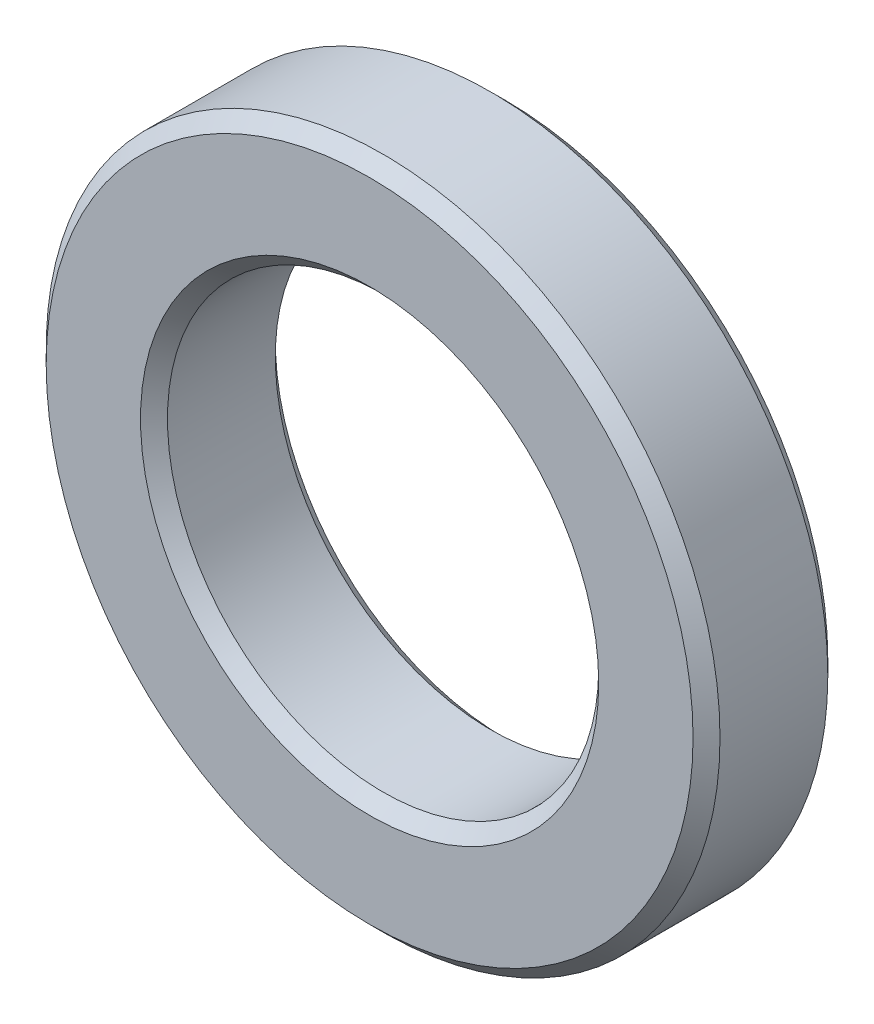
ISO-10303-21;
HEADER;
FILE_DESCRIPTION(('STEP AP214'),'2;1');
FILE_NAME('part.step','',(''),(''),'','','');
FILE_SCHEMA(('AUTOMOTIVE_DESIGN { 1 0 10303 214 1 1 1 1 }'));
ENDSEC;
DATA;
#1=APPLICATION_CONTEXT('core data for automotive mechanical design processes');
#2=APPLICATION_PROTOCOL_DEFINITION('international standard','automotive_design',2000,#1);
#3=PRODUCT_CONTEXT('',#1,'mechanical');
#4=PRODUCT('Part','Part','',(#3));
#5=PRODUCT_RELATED_PRODUCT_CATEGORY('part','',(#4));
#6=PRODUCT_DEFINITION_FORMATION('','',#4);
#7=PRODUCT_DEFINITION_CONTEXT('part definition',#1,'design');
#8=PRODUCT_DEFINITION('design','',#6,#7);
#9=PRODUCT_DEFINITION_SHAPE('','',#8);
#10=(LENGTH_UNIT() NAMED_UNIT(*) SI_UNIT(.MILLI.,.METRE.));
#11=(NAMED_UNIT(*) PLANE_ANGLE_UNIT() SI_UNIT($,.RADIAN.));
#12=(NAMED_UNIT(*) SI_UNIT($,.STERADIAN.) SOLID_ANGLE_UNIT());
#13=UNCERTAINTY_MEASURE_WITH_UNIT(LENGTH_MEASURE(1.E-05),#10,'distance_accuracy_value','');
#14=(GEOMETRIC_REPRESENTATION_CONTEXT(3) GLOBAL_UNCERTAINTY_ASSIGNED_CONTEXT((#13)) GLOBAL_UNIT_ASSIGNED_CONTEXT((#10,
#11,#12)) REPRESENTATION_CONTEXT('',''));
#15=CARTESIAN_POINT('',(0.,0.,0.));
#16=DIRECTION('',(0.,0.,1.));
#17=DIRECTION('',(1.,0.,0.));
#18=AXIS2_PLACEMENT_3D('',#15,#16,#17);
#19=CARTESIAN_POINT('',(0.,0.,1.));
#20=DIRECTION('',(0.,0.,1.));
#21=DIRECTION('',(1.,0.,0.));
#22=AXIS2_PLACEMENT_3D('',#19,#20,#21);
#23=PLANE('',#22);
#24=CARTESIAN_POINT('',(0.,0.,1.));
#25=DIRECTION('',(0.,0.,1.));
#26=DIRECTION('',(1.,0.,0.));
#27=AXIS2_PLACEMENT_3D('',#24,#25,#26);
#28=CIRCLE('',#27,3.4);
#29=CARTESIAN_POINT('',(3.4,0.,1.));
#30=VERTEX_POINT('',#29);
#31=EDGE_CURVE('E10',#30,#30,#28,.F.);
#32=ORIENTED_EDGE('',*,*,#31,.T.);
#33=EDGE_LOOP('',(#32));
#34=FACE_BOUND('',#33,.T.);
#35=CARTESIAN_POINT('',(0.,0.,1.));
#36=DIRECTION('',(0.,0.,1.));
#37=DIRECTION('',(1.,0.,0.));
#38=AXIS2_PLACEMENT_3D('',#35,#36,#37);
#39=CIRCLE('',#38,4.8);
#40=CARTESIAN_POINT('',(4.8,0.,1.));
#41=VERTEX_POINT('',#40);
#42=EDGE_CURVE('E45',#41,#41,#39,.T.);
#43=ORIENTED_EDGE('',*,*,#42,.T.);
#44=EDGE_LOOP('',(#43));
#45=FACE_BOUND('',#44,.T.);
#46=ADVANCED_FACE('F37',(#34,#45),#23,.T.);
#47=CARTESIAN_POINT('',(0.,0.,-1.));
#48=DIRECTION('',(0.,0.,1.));
#49=DIRECTION('',(1.,0.,0.));
#50=AXIS2_PLACEMENT_3D('',#47,#48,#49);
#51=PLANE('',#50);
#52=CARTESIAN_POINT('',(0.,0.,-1.));
#53=DIRECTION('',(0.,0.,1.));
#54=DIRECTION('',(1.,0.,0.));
#55=AXIS2_PLACEMENT_3D('',#52,#53,#54);
#56=CIRCLE('',#55,4.8);
#57=CARTESIAN_POINT('',(4.8,0.,-1.));
#58=VERTEX_POINT('',#57);
#59=EDGE_CURVE('E63',#58,#58,#56,.F.);
#60=ORIENTED_EDGE('',*,*,#59,.T.);
#61=EDGE_LOOP('',(#60));
#62=FACE_BOUND('',#61,.T.);
#63=CARTESIAN_POINT('',(0.,0.,-1.));
#64=DIRECTION('',(0.,0.,1.));
#65=DIRECTION('',(1.,0.,0.));
#66=AXIS2_PLACEMENT_3D('',#63,#64,#65);
#67=CIRCLE('',#66,3.4);
#68=CARTESIAN_POINT('',(3.4,0.,-1.));
#69=VERTEX_POINT('',#68);
#70=EDGE_CURVE('E67',#69,#69,#67,.T.);
#71=ORIENTED_EDGE('',*,*,#70,.T.);
#72=EDGE_LOOP('',(#71));
#73=FACE_BOUND('',#72,.T.);
#74=ADVANCED_FACE('F89',(#62,#73),#51,.F.);
#75=CARTESIAN_POINT('',(0.,0.,1.));
#76=DIRECTION('',(0.,0.,-1.));
#77=DIRECTION('',(-1.,0.,0.));
#78=AXIS2_PLACEMENT_3D('',#75,#76,#77);
#79=CYLINDRICAL_SURFACE('',#78,5.);
#80=CARTESIAN_POINT('',(0.,0.,-0.8));
#81=DIRECTION('',(0.,0.,1.));
#82=DIRECTION('',(1.,0.,0.));
#83=AXIS2_PLACEMENT_3D('',#80,#81,#82);
#84=CIRCLE('',#83,5.);
#85=CARTESIAN_POINT('',(5.,0.,-0.8));
#86=VERTEX_POINT('',#85);
#87=EDGE_CURVE('E70',#86,#86,#84,.T.);
#88=ORIENTED_EDGE('',*,*,#87,.T.);
#89=EDGE_LOOP('',(#88));
#90=FACE_BOUND('',#89,.T.);
#91=CARTESIAN_POINT('',(0.,0.,0.800000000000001));
#92=DIRECTION('',(0.,0.,1.));
#93=DIRECTION('',(1.,0.,0.));
#94=AXIS2_PLACEMENT_3D('',#91,#92,#93);
#95=CIRCLE('',#94,5.);
#96=CARTESIAN_POINT('',(5.,0.,0.800000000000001));
#97=VERTEX_POINT('',#96);
#98=EDGE_CURVE('E73',#97,#97,#95,.F.);
#99=ORIENTED_EDGE('',*,*,#98,.T.);
#100=EDGE_LOOP('',(#99));
#101=FACE_BOUND('',#100,.T.);
#102=ADVANCED_FACE('F78',(#90,#101),#79,.T.);
#103=CARTESIAN_POINT('',(0.,0.,1.));
#104=DIRECTION('',(0.,0.,-1.));
#105=DIRECTION('',(-1.,0.,0.));
#106=AXIS2_PLACEMENT_3D('',#103,#104,#105);
#107=CYLINDRICAL_SURFACE('',#106,3.2);
#108=CARTESIAN_POINT('',(0.,0.,-0.799999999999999));
#109=DIRECTION('',(0.,0.,1.));
#110=DIRECTION('',(1.,0.,0.));
#111=AXIS2_PLACEMENT_3D('',#108,#109,#110);
#112=CIRCLE('',#111,3.2);
#113=CARTESIAN_POINT('',(3.2,0.,-0.799999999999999));
#114=VERTEX_POINT('',#113);
#115=EDGE_CURVE('E51',#114,#114,#112,.F.);
#116=ORIENTED_EDGE('',*,*,#115,.T.);
#117=EDGE_LOOP('',(#116));
#118=FACE_BOUND('',#117,.T.);
#119=CARTESIAN_POINT('',(0.,0.,0.800000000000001));
#120=DIRECTION('',(0.,0.,1.));
#121=DIRECTION('',(1.,0.,0.));
#122=AXIS2_PLACEMENT_3D('',#119,#120,#121);
#123=CIRCLE('',#122,3.2);
#124=CARTESIAN_POINT('',(3.2,0.,0.800000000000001));
#125=VERTEX_POINT('',#124);
#126=EDGE_CURVE('E57',#125,#125,#123,.T.);
#127=ORIENTED_EDGE('',*,*,#126,.T.);
#128=EDGE_LOOP('',(#127));
#129=FACE_BOUND('',#128,.T.);
#130=ADVANCED_FACE('F97',(#118,#129),#107,.F.);
#131=CARTESIAN_POINT('',(0.,0.,-0.8));
#132=DIRECTION('',(0.,0.,1.));
#133=DIRECTION('',(1.,0.,0.));
#134=AXIS2_PLACEMENT_3D('',#131,#132,#133);
#135=CONICAL_SURFACE('',#134,5.,0.785398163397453);
#136=CARTESIAN_POINT('',(4.8,0.,-1.));
#137=CARTESIAN_POINT('',(4.80208333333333,0.,-0.997916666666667));
#138=CARTESIAN_POINT('',(4.80416666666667,0.,-0.995833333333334));
#139=CARTESIAN_POINT('',(4.80833333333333,0.,-0.991666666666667));
#140=CARTESIAN_POINT('',(4.81041666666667,0.,-0.989583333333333));
#141=CARTESIAN_POINT('',(4.81458333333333,0.,-0.985416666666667));
#142=CARTESIAN_POINT('',(4.81666666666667,0.,-0.983333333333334));
#143=CARTESIAN_POINT('',(4.82083333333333,0.,-0.979166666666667));
#144=CARTESIAN_POINT('',(4.82291666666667,0.,-0.977083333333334));
#145=CARTESIAN_POINT('',(4.82708333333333,0.,-0.972916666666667));
#146=CARTESIAN_POINT('',(4.82916666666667,0.,-0.970833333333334));
#147=CARTESIAN_POINT('',(4.83333333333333,0.,-0.966666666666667));
#148=CARTESIAN_POINT('',(4.83541666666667,0.,-0.964583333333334));
#149=CARTESIAN_POINT('',(4.83958333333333,0.,-0.960416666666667));
#150=CARTESIAN_POINT('',(4.84166666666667,0.,-0.958333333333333));
#151=CARTESIAN_POINT('',(4.84583333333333,0.,-0.954166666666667));
#152=CARTESIAN_POINT('',(4.84791666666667,0.,-0.952083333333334));
#153=CARTESIAN_POINT('',(4.85208333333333,0.,-0.947916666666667));
#154=CARTESIAN_POINT('',(4.85416666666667,0.,-0.945833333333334));
#155=CARTESIAN_POINT('',(4.85833333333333,0.,-0.941666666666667));
#156=CARTESIAN_POINT('',(4.86041666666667,0.,-0.939583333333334));
#157=CARTESIAN_POINT('',(4.86458333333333,0.,-0.935416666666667));
#158=CARTESIAN_POINT('',(4.86666666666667,0.,-0.933333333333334));
#159=CARTESIAN_POINT('',(4.87083333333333,0.,-0.929166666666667));
#160=CARTESIAN_POINT('',(4.87291666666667,0.,-0.927083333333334));
#161=CARTESIAN_POINT('',(4.87708333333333,0.,-0.922916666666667));
#162=CARTESIAN_POINT('',(4.87916666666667,0.,-0.920833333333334));
#163=CARTESIAN_POINT('',(4.88333333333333,0.,-0.916666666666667));
#164=CARTESIAN_POINT('',(4.88541666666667,0.,-0.914583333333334));
#165=CARTESIAN_POINT('',(4.88958333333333,0.,-0.910416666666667));
#166=CARTESIAN_POINT('',(4.89166666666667,0.,-0.908333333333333));
#167=CARTESIAN_POINT('',(4.89583333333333,0.,-0.904166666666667));
#168=CARTESIAN_POINT('',(4.89791666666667,0.,-0.902083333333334));
#169=CARTESIAN_POINT('',(4.90208333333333,0.,-0.897916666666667));
#170=CARTESIAN_POINT('',(4.90416666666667,0.,-0.895833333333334));
#171=CARTESIAN_POINT('',(4.90833333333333,0.,-0.891666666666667));
#172=CARTESIAN_POINT('',(4.91041666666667,0.,-0.889583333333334));
#173=CARTESIAN_POINT('',(4.91458333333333,0.,-0.885416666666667));
#174=CARTESIAN_POINT('',(4.91666666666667,0.,-0.883333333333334));
#175=CARTESIAN_POINT('',(4.92083333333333,0.,-0.879166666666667));
#176=CARTESIAN_POINT('',(4.92291666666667,0.,-0.877083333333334));
#177=CARTESIAN_POINT('',(4.92708333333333,0.,-0.872916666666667));
#178=CARTESIAN_POINT('',(4.92916666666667,0.,-0.870833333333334));
#179=CARTESIAN_POINT('',(4.93333333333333,0.,-0.866666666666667));
#180=CARTESIAN_POINT('',(4.93541666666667,0.,-0.864583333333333));
#181=CARTESIAN_POINT('',(4.93958333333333,0.,-0.860416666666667));
#182=CARTESIAN_POINT('',(4.94166666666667,0.,-0.858333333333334));
#183=CARTESIAN_POINT('',(4.94583333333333,0.,-0.854166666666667));
#184=CARTESIAN_POINT('',(4.94791666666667,0.,-0.852083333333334));
#185=CARTESIAN_POINT('',(4.95208333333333,0.,-0.847916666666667));
#186=CARTESIAN_POINT('',(4.95416666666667,0.,-0.845833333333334));
#187=CARTESIAN_POINT('',(4.95833333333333,0.,-0.841666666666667));
#188=CARTESIAN_POINT('',(4.96041666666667,0.,-0.839583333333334));
#189=CARTESIAN_POINT('',(4.96458333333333,0.,-0.835416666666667));
#190=CARTESIAN_POINT('',(4.96666666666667,0.,-0.833333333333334));
#191=CARTESIAN_POINT('',(4.97083333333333,0.,-0.829166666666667));
#192=CARTESIAN_POINT('',(4.97291666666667,0.,-0.827083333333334));
#193=CARTESIAN_POINT('',(4.97708333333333,0.,-0.822916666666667));
#194=CARTESIAN_POINT('',(4.97916666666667,0.,-0.820833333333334));
#195=CARTESIAN_POINT('',(4.98333333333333,0.,-0.816666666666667));
#196=CARTESIAN_POINT('',(4.98541666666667,0.,-0.814583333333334));
#197=CARTESIAN_POINT('',(4.98958333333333,0.,-0.810416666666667));
#198=CARTESIAN_POINT('',(4.99166666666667,0.,-0.808333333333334));
#199=CARTESIAN_POINT('',(4.99583333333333,0.,-0.804166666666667));
#200=CARTESIAN_POINT('',(4.99791666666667,0.,-0.802083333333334));
#201=CARTESIAN_POINT('',(5.,0.,-0.8));
#202=B_SPLINE_CURVE_WITH_KNOTS('',3,(#136,#137,#138,#139,#140,#141,#142,#143,#144,#145,#146,
#147,#148,#149,#150,#151,#152,#153,#154,#155,#156,#157,#158,#159,#160,#161,#162,#163,#164,#165,
#166,#167,#168,#169,#170,#171,#172,#173,#174,#175,#176,#177,#178,#179,#180,#181,#182,#183,#184,
#185,#186,#187,#188,#189,#190,#191,#192,#193,#194,#195,#196,#197,#198,#199,#200,#201),
.UNSPECIFIED.,.F.,.F.,(4,2,2,2,2,2,2,2,2,2,2,2,2,2,2,2,2,2,2,2,2,2,2,2,2,2,2,2,2,2,2,2,4),(0.,
0.00883883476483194,0.0176776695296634,0.0265165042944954,0.0353553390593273,0.0441941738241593,
0.0530330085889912,0.0618718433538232,0.0707106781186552,0.0795495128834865,0.0883883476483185,
0.0972271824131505,0.106066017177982,0.114904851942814,0.123743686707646,0.132582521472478,
0.14142135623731,0.150260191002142,0.159099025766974,0.167937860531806,0.176776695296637,
0.185615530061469,0.194454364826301,0.203293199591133,0.212132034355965,0.220970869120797,
0.229809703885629,0.238648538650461,0.247487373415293,0.256326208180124,0.265165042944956,
0.274003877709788,0.28284271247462),.UNSPECIFIED.);
#203=EDGE_CURVE('BSEAM102',#58,#86,#202,.T.);
#204=ORIENTED_EDGE('',*,*,#59,.F.);
#205=ORIENTED_EDGE('',*,*,#87,.F.);
#206=ORIENTED_EDGE('',*,*,#203,.T.);
#207=ORIENTED_EDGE('',*,*,#203,.F.);
#208=EDGE_LOOP('',(#204,#206,#205,#207));
#209=FACE_BOUND('',#208,.T.);
#210=ADVANCED_FACE('F102',(#209),#135,.T.);
#211=CARTESIAN_POINT('',(0.,0.,-1.));
#212=DIRECTION('',(0.,0.,-1.));
#213=DIRECTION('',(-1.,0.,0.));
#214=AXIS2_PLACEMENT_3D('',#211,#212,#213);
#215=CONICAL_SURFACE('',#214,3.4,0.785398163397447);
#216=ORIENTED_EDGE('',*,*,#115,.F.);
#217=EDGE_LOOP('',(#216));
#218=FACE_BOUND('',#217,.T.);
#219=ORIENTED_EDGE('',*,*,#70,.F.);
#220=EDGE_LOOP('',(#219));
#221=FACE_BOUND('',#220,.T.);
#222=ADVANCED_FACE('F86',(#218,#221),#215,.F.);
#223=CARTESIAN_POINT('',(0.,0.,0.800000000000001));
#224=DIRECTION('',(0.,0.,1.));
#225=DIRECTION('',(1.,0.,0.));
#226=AXIS2_PLACEMENT_3D('',#223,#224,#225);
#227=CONICAL_SURFACE('',#226,3.2,0.785398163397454);
#228=ORIENTED_EDGE('',*,*,#31,.F.);
#229=EDGE_LOOP('',(#228));
#230=FACE_BOUND('',#229,.T.);
#231=ORIENTED_EDGE('',*,*,#126,.F.);
#232=EDGE_LOOP('',(#231));
#233=FACE_BOUND('',#232,.T.);
#234=ADVANCED_FACE('F82',(#230,#233),#227,.F.);
#235=CARTESIAN_POINT('',(0.,0.,1.));
#236=DIRECTION('',(0.,0.,-1.));
#237=DIRECTION('',(-1.,0.,0.));
#238=AXIS2_PLACEMENT_3D('',#235,#236,#237);
#239=CONICAL_SURFACE('',#238,4.8,0.78539816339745);
#240=ORIENTED_EDGE('',*,*,#98,.F.);
#241=EDGE_LOOP('',(#240));
#242=FACE_BOUND('',#241,.T.);
#243=ORIENTED_EDGE('',*,*,#42,.F.);
#244=EDGE_LOOP('',(#243));
#245=FACE_BOUND('',#244,.T.);
#246=ADVANCED_FACE('F39',(#242,#245),#239,.T.);
#247=CLOSED_SHELL('',(#46,#74,#102,#130,#210,#222,#234,#246));
#248=MANIFOLD_SOLID_BREP('B2',#247);
#249=ADVANCED_BREP_SHAPE_REPRESENTATION('',(#18,#248),#14);
#250=SHAPE_DEFINITION_REPRESENTATION(#9,#249);
ENDSEC;
END-ISO-10303-21;
